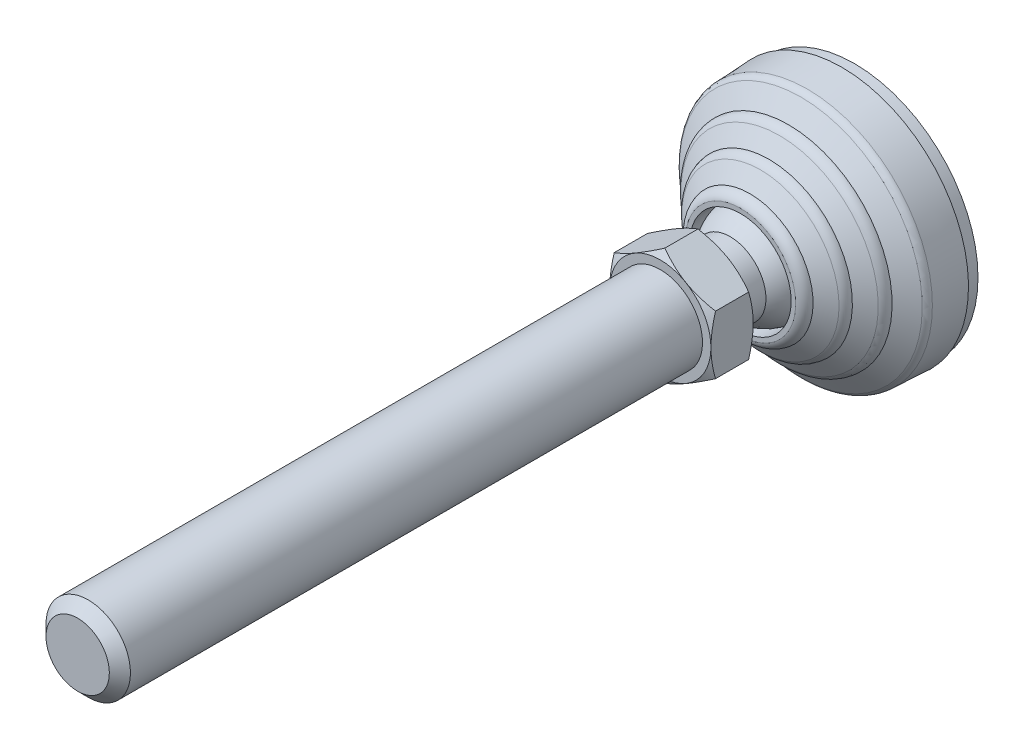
ISO-10303-21;
HEADER;
FILE_DESCRIPTION(('STEP AP214'),'2;1');
FILE_NAME('part.step','',(''),(''),'','','');
FILE_SCHEMA(('AUTOMOTIVE_DESIGN { 1 0 10303 214 1 1 1 1 }'));
ENDSEC;
DATA;
#1=APPLICATION_CONTEXT('core data for automotive mechanical design processes');
#2=APPLICATION_PROTOCOL_DEFINITION('international standard','automotive_design',2000,#1);
#3=PRODUCT_CONTEXT('',#1,'mechanical');
#4=PRODUCT('Part','Part','',(#3));
#5=PRODUCT_RELATED_PRODUCT_CATEGORY('part','',(#4));
#6=PRODUCT_DEFINITION_FORMATION('','',#4);
#7=PRODUCT_DEFINITION_CONTEXT('part definition',#1,'design');
#8=PRODUCT_DEFINITION('design','',#6,#7);
#9=PRODUCT_DEFINITION_SHAPE('','',#8);
#10=(LENGTH_UNIT() NAMED_UNIT(*) SI_UNIT(.MILLI.,.METRE.));
#11=(NAMED_UNIT(*) PLANE_ANGLE_UNIT() SI_UNIT($,.RADIAN.));
#12=(NAMED_UNIT(*) SI_UNIT($,.STERADIAN.) SOLID_ANGLE_UNIT());
#13=UNCERTAINTY_MEASURE_WITH_UNIT(LENGTH_MEASURE(1.E-05),#10,'distance_accuracy_value','');
#14=(GEOMETRIC_REPRESENTATION_CONTEXT(3) GLOBAL_UNCERTAINTY_ASSIGNED_CONTEXT((#13)) GLOBAL_UNIT_ASSIGNED_CONTEXT((#10,
#11,#12)) REPRESENTATION_CONTEXT('',''));
#15=CARTESIAN_POINT('',(0.,0.,0.));
#16=DIRECTION('',(0.,0.,1.));
#17=DIRECTION('',(1.,0.,0.));
#18=AXIS2_PLACEMENT_3D('',#15,#16,#17);
#19=CARTESIAN_POINT('',(0.,0.,93.4665));
#20=DIRECTION('',(0.,0.,-1.));
#21=DIRECTION('',(0.,1.,0.));
#22=AXIS2_PLACEMENT_3D('',#19,#20,#21);
#23=CYLINDRICAL_SURFACE('',#22,10.);
#24=CARTESIAN_POINT('',(0.,0.,181.5));
#25=DIRECTION('',(0.,0.,1.));
#26=DIRECTION('',(0.,-1.,0.));
#27=AXIS2_PLACEMENT_3D('',#24,#25,#26);
#28=CIRCLE('',#27,10.);
#29=CARTESIAN_POINT('',(0.,-10.,181.5));
#30=VERTEX_POINT('',#29);
#31=EDGE_CURVE('E9',#30,#30,#28,.F.);
#32=ORIENTED_EDGE('',*,*,#31,.T.);
#33=EDGE_LOOP('',(#32));
#34=FACE_BOUND('',#33,.T.);
#35=CARTESIAN_POINT('',(0.,0.,46.));
#36=DIRECTION('',(0.,0.,-1.));
#37=DIRECTION('',(0.,1.,0.));
#38=AXIS2_PLACEMENT_3D('',#35,#36,#37);
#39=CIRCLE('',#38,10.);
#40=CARTESIAN_POINT('',(0.,10.,46.));
#41=VERTEX_POINT('',#40);
#42=EDGE_CURVE('E124',#41,#41,#39,.F.);
#43=ORIENTED_EDGE('',*,*,#42,.T.);
#44=EDGE_LOOP('',(#43));
#45=FACE_BOUND('',#44,.T.);
#46=ADVANCED_FACE('F14',(#34,#45),#23,.T.);
#47=CARTESIAN_POINT('',(10.995,0.,46.));
#48=DIRECTION('',(0.,0.,1.));
#49=DIRECTION('',(0.,-1.,0.));
#50=AXIS2_PLACEMENT_3D('',#47,#48,#49);
#51=PLANE('',#50);
#52=CARTESIAN_POINT('',(0.,0.,46.));
#53=DIRECTION('',(0.,0.,-1.));
#54=DIRECTION('',(0.,1.,0.));
#55=AXIS2_PLACEMENT_3D('',#52,#53,#54);
#56=CIRCLE('',#55,11.99);
#57=CARTESIAN_POINT('',(0.,11.99,46.));
#58=VERTEX_POINT('',#57);
#59=EDGE_CURVE('E132',#58,#58,#56,.F.);
#60=ORIENTED_EDGE('',*,*,#59,.T.);
#61=EDGE_LOOP('',(#60));
#62=FACE_BOUND('',#61,.T.);
#63=ORIENTED_EDGE('',*,*,#42,.F.);
#64=EDGE_LOOP('',(#63));
#65=FACE_BOUND('',#64,.T.);
#66=ADVANCED_FACE('F157',(#62,#65),#51,.T.);
#67=CARTESIAN_POINT('',(0.,0.,44.9159643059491));
#68=DIRECTION('',(0.,0.,-1.));
#69=DIRECTION('',(0.,1.,0.));
#70=AXIS2_PLACEMENT_3D('',#67,#68,#69);
#71=CONICAL_SURFACE('',#70,13.8676048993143,1.0471975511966);
#72=ORIENTED_EDGE('',*,*,#59,.F.);
#73=EDGE_LOOP('',(#72));
#74=FACE_BOUND('',#73,.T.);
#75=CARTESIAN_POINT('',(-2.88482840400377E-08,-13.8564064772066,44.9224297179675));
#76=CARTESIAN_POINT('',(0.263784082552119,-13.7041106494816,45.010340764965));
#77=CARTESIAN_POINT('',(0.528551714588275,-13.5512469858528,45.0942615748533));
#78=CARTESIAN_POINT('',(1.06021019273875,-13.2442938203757,45.2530155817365));
#79=CARTESIAN_POINT('',(1.32710170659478,-13.0902039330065,45.3278457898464));
#80=CARTESIAN_POINT('',(2.13207647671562,-12.6254515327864,45.537252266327));
#81=CARTESIAN_POINT('',(2.67333741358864,-12.3129543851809,45.6563603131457));
#82=CARTESIAN_POINT('',(3.48330954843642,-11.8453167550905,45.796023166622));
#83=CARTESIAN_POINT('',(3.74960108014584,-11.6915732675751,45.8358073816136));
#84=CARTESIAN_POINT('',(4.28341699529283,-11.3833745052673,45.9025217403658));
#85=CARTESIAN_POINT('',(4.55094140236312,-11.2289192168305,45.9294516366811));
#86=CARTESIAN_POINT('',(5.08643614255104,-10.9197511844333,45.9697675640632));
#87=CARTESIAN_POINT('',(5.35440556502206,-10.7650389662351,45.9831696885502));
#88=CARTESIAN_POINT('',(5.8905925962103,-10.4554712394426,45.996144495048));
#89=CARTESIAN_POINT('',(6.15881019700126,-10.3006157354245,45.9957176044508));
#90=CARTESIAN_POINT('',(6.66023029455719,-10.0111207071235,45.9820002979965));
#91=CARTESIAN_POINT('',(6.89346857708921,-9.87646052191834,45.97038309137));
#92=CARTESIAN_POINT('',(7.35940867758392,-9.60744987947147,45.9369099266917));
#93=CARTESIAN_POINT('',(7.59211045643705,-9.47309944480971,45.9150532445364));
#94=CARTESIAN_POINT('',(8.05685109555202,-9.20478131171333,45.8614821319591));
#95=CARTESIAN_POINT('',(8.28888924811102,-9.07081402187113,45.8297595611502));
#96=CARTESIAN_POINT('',(8.75187776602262,-8.80350747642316,45.7570131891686));
#97=CARTESIAN_POINT('',(8.98282805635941,-8.67016826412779,45.7159887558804));
#98=CARTESIAN_POINT('',(9.68388987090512,-8.26541003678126,45.5779256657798));
#99=CARTESIAN_POINT('',(10.1519713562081,-7.99516306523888,45.4671213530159));
#100=CARTESIAN_POINT('',(11.081155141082,-7.45869855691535,45.2156417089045));
#101=CARTESIAN_POINT('',(11.5422693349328,-7.19247415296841,45.075025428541));
#102=CARTESIAN_POINT('',(11.9999999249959,-6.92820327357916,44.922429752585));
#103=B_SPLINE_CURVE_WITH_KNOTS('',3,(#75,#76,#77,#78,#79,#80,#81,#82,#83,#84,#85,#86,#87,#88,
#89,#90,#91,#92,#93,#94,#95,#96,#97,#98,#99,#100,#101,#102),.UNSPECIFIED.,.F.,.F.,(4,2,2,2,2,2,
2,2,2,2,2,2,2,4),(0.,0.950996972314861,1.90230578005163,3.80897261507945,4.73890631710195,
5.6688579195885,6.59770188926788,7.52651715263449,8.33503482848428,9.14360968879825,
9.95285348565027,10.7621522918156,12.4163368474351,14.0672749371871),.UNSPECIFIED.);
#104=CARTESIAN_POINT('',(-1.44241383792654E-08,-13.8564064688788,44.9224297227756));
#105=VERTEX_POINT('',#104);
#106=CARTESIAN_POINT('',(12.,-6.92820324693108,44.9224297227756));
#107=VERTEX_POINT('',#106);
#108=EDGE_CURVE('E143',#105,#107,#103,.T.);
#109=ORIENTED_EDGE('',*,*,#108,.T.);
#110=CARTESIAN_POINT('',(12.,-6.92820326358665,44.9224297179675));
#111=CARTESIAN_POINT('',(12.,-6.64374493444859,45.0045333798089));
#112=CARTESIAN_POINT('',(12.,-6.35829458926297,45.0831531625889));
#113=CARTESIAN_POINT('',(12.,-5.78524260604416,45.2325348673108));
#114=CARTESIAN_POINT('',(12.,-5.49764024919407,45.3032940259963));
#115=CARTESIAN_POINT('',(12.,-4.63053083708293,45.5026195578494));
#116=CARTESIAN_POINT('',(12.,-4.04782834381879,45.6179071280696));
#117=CARTESIAN_POINT('',(12.,-3.17548925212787,45.7575170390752));
#118=CARTESIAN_POINT('',(12.,-2.88840964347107,45.7982045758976));
#119=CARTESIAN_POINT('',(12.,-2.31290718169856,45.8685767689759));
#120=CARTESIAN_POINT('',(12.,-2.02448443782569,45.8982623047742));
#121=CARTESIAN_POINT('',(12.,-1.44696804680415,45.9459902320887));
#122=CARTESIAN_POINT('',(12.,-1.15787537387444,45.9640443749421));
#123=CARTESIAN_POINT('',(12.,-0.579188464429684,45.9881624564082));
#124=CARTESIAN_POINT('',(12.,-0.289594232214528,45.994226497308));
#125=CARTESIAN_POINT('',(12.,0.289594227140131,45.9942264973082));
#126=CARTESIAN_POINT('',(12.,0.579188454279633,45.9881624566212));
#127=CARTESIAN_POINT('',(12.,1.15787535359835,45.9640443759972));
#128=CARTESIAN_POINT('',(12.,1.44696802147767,45.9459902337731));
#129=CARTESIAN_POINT('',(12.,2.02448440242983,45.8982623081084));
#130=CARTESIAN_POINT('',(12.,2.31290714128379,45.8685767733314));
#131=CARTESIAN_POINT('',(12.,2.88840959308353,45.798204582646));
#132=CARTESIAN_POINT('',(12.,3.17548919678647,45.7575170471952));
#133=CARTESIAN_POINT('',(12.,4.04782827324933,45.6179071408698));
#134=CARTESIAN_POINT('',(12.,4.63053075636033,45.5026195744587));
#135=CARTESIAN_POINT('',(12.,5.49764015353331,45.3032940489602));
#136=CARTESIAN_POINT('',(12.,5.78524250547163,45.2325348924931));
#137=CARTESIAN_POINT('',(12.,6.35829447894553,45.0831531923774));
#138=CARTESIAN_POINT('',(12.,6.64374481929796,45.004533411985));
#139=CARTESIAN_POINT('',(12.,6.92820314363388,44.9224297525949));
#140=B_SPLINE_CURVE_WITH_KNOTS('',3,(#110,#111,#112,#113,#114,#115,#116,#117,#118,#119,#120,
#121,#122,#123,#124,#125,#126,#127,#128,#129,#130,#131,#132,#133,#134,#135,#136,#137,#138,#139),
.UNSPECIFIED.,.F.,.F.,(4,2,2,2,2,2,2,2,2,2,2,2,2,2,4),(0.,0.888148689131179,1.77660860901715,
3.55698615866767,4.42666281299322,5.2962699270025,6.16499708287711,7.03371682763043,
7.90243655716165,8.7711636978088,9.64077079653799,10.5104474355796,12.2908249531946,
13.1792848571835,14.0674335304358),.UNSPECIFIED.);
#141=CARTESIAN_POINT('',(12.0000000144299,6.92820322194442,44.9224297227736));
#142=VERTEX_POINT('',#141);
#143=EDGE_CURVE('E135',#107,#142,#140,.T.);
#144=ORIENTED_EDGE('',*,*,#143,.T.);
#145=CARTESIAN_POINT('',(12.0000000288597,6.92820321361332,44.9224297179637));
#146=CARTESIAN_POINT('',(11.7362159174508,7.08049904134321,45.0103407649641));
#147=CARTESIAN_POINT('',(11.4714482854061,7.23336270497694,45.0942615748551));
#148=CARTESIAN_POINT('',(10.9397898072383,7.54031587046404,45.2530155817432));
#149=CARTESIAN_POINT('',(10.6728982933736,7.69440575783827,45.3278457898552));
#150=CARTESIAN_POINT('',(9.86792352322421,8.15915815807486,45.5372522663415));
#151=CARTESIAN_POINT('',(9.32666258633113,8.47165530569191,45.6563603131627));
#152=CARTESIAN_POINT('',(8.51669045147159,8.93929293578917,45.7960231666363));
#153=CARTESIAN_POINT('',(8.25039891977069,9.0930364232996,45.8358073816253));
#154=CARTESIAN_POINT('',(7.71658300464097,9.40123518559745,45.9025217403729));
#155=CARTESIAN_POINT('',(7.44905859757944,9.55569047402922,45.9294516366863));
#156=CARTESIAN_POINT('',(6.91356385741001,9.86485850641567,45.9697675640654));
#157=CARTESIAN_POINT('',(6.64559443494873,10.0195707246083,45.9831696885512));
#158=CARTESIAN_POINT('',(6.10940740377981,10.3291384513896,45.996144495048));
#159=CARTESIAN_POINT('',(5.84118980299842,10.4839939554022,45.9957176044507));
#160=CARTESIAN_POINT('',(5.33976970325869,10.773488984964,45.9820002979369));
#161=CARTESIAN_POINT('',(5.10653141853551,10.9081491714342,45.970383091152));
#162=CARTESIAN_POINT('',(4.64059131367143,11.1771598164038,45.9369099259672));
#163=CARTESIAN_POINT('',(4.4078895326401,11.3115102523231,45.9150532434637));
#164=CARTESIAN_POINT('',(3.94314888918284,11.5798283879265,45.8614821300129));
#165=CARTESIAN_POINT('',(3.71111073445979,11.7137956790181,45.8297595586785));
#166=CARTESIAN_POINT('',(3.24812221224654,11.9811022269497,45.7570131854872));
#167=CARTESIAN_POINT('',(3.01717191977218,12.1144414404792,45.7159887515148));
#168=CARTESIAN_POINT('',(2.31611009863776,12.5191996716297,45.5779256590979));
#169=CARTESIAN_POINT('',(1.84802860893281,12.7894466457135,45.4671213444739));
#170=CARTESIAN_POINT('',(0.918844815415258,13.3259111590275,45.2156416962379));
#171=CARTESIAN_POINT('',(0.457730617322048,13.5921355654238,45.0750254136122));
#172=CARTESIAN_POINT('',(2.30778996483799E-08,13.856406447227,44.9224297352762));
#173=B_SPLINE_CURVE_WITH_KNOTS('',3,(#145,#146,#147,#148,#149,#150,#151,#152,#153,#154,#155,
#156,#157,#158,#159,#160,#161,#162,#163,#164,#165,#166,#167,#168,#169,#170,#171,#172),
.UNSPECIFIED.,.F.,.F.,(4,2,2,2,2,2,2,2,2,2,2,2,2,4),(0.,0.95099697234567,1.9023057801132,
3.8089726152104,4.73890631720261,5.66885791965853,6.59770188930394,7.52651715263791,
8.33503483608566,9.14360970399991,9.95285350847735,10.7621523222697,12.4163368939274,
14.0672749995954),.UNSPECIFIED.);
#174=CARTESIAN_POINT('',(-1.15389591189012E-08,13.856406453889,44.92242973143));
#175=VERTEX_POINT('',#174);
#176=EDGE_CURVE('E180',#142,#175,#173,.T.);
#177=ORIENTED_EDGE('',*,*,#176,.T.);
#178=CARTESIAN_POINT('',(-2.30779115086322E-08,13.856406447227,44.9224297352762));
#179=CARTESIAN_POINT('',(-0.263784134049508,13.7041106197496,45.0103407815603));
#180=CARTESIAN_POINT('',(-0.528551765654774,13.5512469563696,45.0942615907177));
#181=CARTESIAN_POINT('',(-1.06021024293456,13.2442937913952,45.2530155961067));
#182=CARTESIAN_POINT('',(-1.32710175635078,13.0902039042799,45.3278458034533));
#183=CARTESIAN_POINT('',(-2.13207652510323,12.6254515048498,45.5372522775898));
#184=CARTESIAN_POINT('',(-2.67333746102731,12.3129543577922,45.656360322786));
#185=CARTESIAN_POINT('',(-3.48330959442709,11.8453167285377,45.7960231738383));
#186=CARTESIAN_POINT('',(-3.74960112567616,11.6915732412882,45.8358073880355));
#187=CARTESIAN_POINT('',(-4.28341703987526,11.3833744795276,45.9025217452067));
#188=CARTESIAN_POINT('',(-4.55094144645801,11.2289191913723,45.9294516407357));
#189=CARTESIAN_POINT('',(-5.08643618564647,10.9197511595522,45.9697675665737));
#190=CARTESIAN_POINT('',(-5.35440560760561,10.7650389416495,45.9831696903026));
#191=CARTESIAN_POINT('',(-5.89059263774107,10.4554712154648,45.9961444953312));
#192=CARTESIAN_POINT('',(-6.15881023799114,10.300615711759,45.9957176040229));
#193=CARTESIAN_POINT('',(-6.66023033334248,10.0111206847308,45.9820002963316));
#194=CARTESIAN_POINT('',(-6.89346861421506,9.87646050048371,45.9703830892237));
#195=CARTESIAN_POINT('',(-7.35940871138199,9.60744985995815,45.9369099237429));
#196=CARTESIAN_POINT('',(-7.59211048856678,9.47309942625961,45.9150532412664));
#197=CARTESIAN_POINT('',(-8.05685112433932,9.20478129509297,45.8614821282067));
#198=CARTESIAN_POINT('',(-8.28888927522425,9.0708140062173,45.8297595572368));
#199=CARTESIAN_POINT('',(-8.75187778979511,8.80350746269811,45.7570131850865));
#200=CARTESIAN_POINT('',(-8.98282807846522,8.67016825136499,45.7159887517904));
#201=CARTESIAN_POINT('',(-9.68388988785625,8.26541002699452,45.5779256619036));
#202=CARTESIAN_POINT('',(-10.1519713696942,7.9951630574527,45.4671213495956));
#203=CARTESIAN_POINT('',(-11.0811551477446,7.45869855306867,45.2156417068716));
#204=CARTESIAN_POINT('',(-11.5422693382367,7.19247415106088,45.0750254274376));
#205=CARTESIAN_POINT('',(-11.9999999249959,6.92820327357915,44.922429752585));
#206=B_SPLINE_CURVE_WITH_KNOTS('',3,(#178,#179,#180,#181,#182,#183,#184,#185,#186,#187,#188,
#189,#190,#191,#192,#193,#194,#195,#196,#197,#198,#199,#200,#201,#202,#203,#204,#205),
.UNSPECIFIED.,.F.,.F.,(4,2,2,2,2,2,2,2,2,2,2,2,2,4),(0.,0.9509969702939,1.90230577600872,
3.80897260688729,4.73890630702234,5.6688579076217,6.5977018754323,7.52651713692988,
8.33503480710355,9.14360966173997,9.95285345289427,10.7621522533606,12.4163367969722,
14.0672748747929),.UNSPECIFIED.);
#207=CARTESIAN_POINT('',(-12.,6.92820324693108,44.9224297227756));
#208=VERTEX_POINT('',#207);
#209=EDGE_CURVE('E172',#175,#208,#206,.T.);
#210=ORIENTED_EDGE('',*,*,#209,.T.);
#211=CARTESIAN_POINT('',(-12.,6.92820326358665,44.9224297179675));
#212=CARTESIAN_POINT('',(-12.,6.64374493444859,45.0045333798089));
#213=CARTESIAN_POINT('',(-12.,6.35829458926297,45.0831531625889));
#214=CARTESIAN_POINT('',(-12.,5.78524260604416,45.2325348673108));
#215=CARTESIAN_POINT('',(-12.,5.49764024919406,45.3032940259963));
#216=CARTESIAN_POINT('',(-12.,4.63053083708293,45.5026195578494));
#217=CARTESIAN_POINT('',(-12.,4.04782834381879,45.6179071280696));
#218=CARTESIAN_POINT('',(-12.,3.17548925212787,45.7575170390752));
#219=CARTESIAN_POINT('',(-12.,2.88840964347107,45.7982045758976));
#220=CARTESIAN_POINT('',(-12.,2.31290718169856,45.8685767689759));
#221=CARTESIAN_POINT('',(-12.,2.02448443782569,45.8982623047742));
#222=CARTESIAN_POINT('',(-12.,1.44696804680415,45.9459902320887));
#223=CARTESIAN_POINT('',(-12.,1.15787537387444,45.9640443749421));
#224=CARTESIAN_POINT('',(-12.,0.579188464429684,45.9881624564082));
#225=CARTESIAN_POINT('',(-12.,0.289594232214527,45.994226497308));
#226=CARTESIAN_POINT('',(-12.,-0.289594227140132,45.9942264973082));
#227=CARTESIAN_POINT('',(-12.,-0.579188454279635,45.9881624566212));
#228=CARTESIAN_POINT('',(-12.,-1.15787535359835,45.9640443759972));
#229=CARTESIAN_POINT('',(-12.,-1.44696802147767,45.9459902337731));
#230=CARTESIAN_POINT('',(-12.,-2.02448440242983,45.8982623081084));
#231=CARTESIAN_POINT('',(-12.,-2.31290714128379,45.8685767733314));
#232=CARTESIAN_POINT('',(-12.,-2.88840959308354,45.798204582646));
#233=CARTESIAN_POINT('',(-12.,-3.17548919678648,45.7575170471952));
#234=CARTESIAN_POINT('',(-12.,-4.04782827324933,45.6179071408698));
#235=CARTESIAN_POINT('',(-12.,-4.63053075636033,45.5026195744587));
#236=CARTESIAN_POINT('',(-12.,-5.49764015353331,45.3032940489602));
#237=CARTESIAN_POINT('',(-12.,-5.78524250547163,45.2325348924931));
#238=CARTESIAN_POINT('',(-12.,-6.35829447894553,45.0831531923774));
#239=CARTESIAN_POINT('',(-12.,-6.64374481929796,45.004533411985));
#240=CARTESIAN_POINT('',(-12.,-6.92820314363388,44.9224297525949));
#241=B_SPLINE_CURVE_WITH_KNOTS('',3,(#211,#212,#213,#214,#215,#216,#217,#218,#219,#220,#221,
#222,#223,#224,#225,#226,#227,#228,#229,#230,#231,#232,#233,#234,#235,#236,#237,#238,#239,#240),
.UNSPECIFIED.,.F.,.F.,(4,2,2,2,2,2,2,2,2,2,2,2,2,2,4),(0.,0.888148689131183,1.77660860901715,
3.55698615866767,4.42666281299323,5.2962699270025,6.16499708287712,7.03371682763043,
7.90243655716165,8.7711636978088,9.640770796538,10.5104474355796,12.2908249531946,
13.1792848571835,14.0674335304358),.UNSPECIFIED.);
#242=CARTESIAN_POINT('',(-12.0000000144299,-6.92820322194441,44.9224297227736));
#243=VERTEX_POINT('',#242);
#244=EDGE_CURVE('E350',#208,#243,#241,.T.);
#245=ORIENTED_EDGE('',*,*,#244,.T.);
#246=CARTESIAN_POINT('',(-12.0000000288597,-6.92820321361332,44.9224297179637));
#247=CARTESIAN_POINT('',(-11.7362159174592,-7.08049904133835,45.0103407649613));
#248=CARTESIAN_POINT('',(-11.471448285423,-7.23336270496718,45.0942615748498));
#249=CARTESIAN_POINT('',(-10.9397898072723,-7.54031587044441,45.2530155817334));
#250=CARTESIAN_POINT('',(-10.6728982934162,-7.69440575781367,45.3278457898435));
#251=CARTESIAN_POINT('',(-9.86792352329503,-8.15915815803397,45.5372522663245));
#252=CARTESIAN_POINT('',(-9.3266625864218,-8.47165530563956,45.6563603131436));
#253=CARTESIAN_POINT('',(-8.5166904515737,-8.93929293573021,45.7960231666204));
#254=CARTESIAN_POINT('',(-8.25039891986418,-9.09303642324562,45.8358073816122));
#255=CARTESIAN_POINT('',(-7.71658300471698,-9.40123518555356,45.9025217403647));
#256=CARTESIAN_POINT('',(-7.44905859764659,-9.55569047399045,45.9294516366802));
#257=CARTESIAN_POINT('',(-6.91356385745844,-9.8648585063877,45.9697675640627));
#258=CARTESIAN_POINT('',(-6.64559443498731,-10.019570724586,45.9831696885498));
#259=CARTESIAN_POINT('',(-6.10940740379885,-10.3291384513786,45.996144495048));
#260=CARTESIAN_POINT('',(-5.84118980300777,-10.4839939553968,45.9957176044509));
#261=CARTESIAN_POINT('',(-5.33976970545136,-10.7734889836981,45.9820002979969));
#262=CARTESIAN_POINT('',(-5.10653142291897,-10.9081491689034,45.9703830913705));
#263=CARTESIAN_POINT('',(-4.64059132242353,-11.1771598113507,45.9369099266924));
#264=CARTESIAN_POINT('',(-4.40788954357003,-11.3115102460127,45.9150532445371));
#265=CARTESIAN_POINT('',(-3.94314890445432,-11.5798283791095,45.8614821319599));
#266=CARTESIAN_POINT('',(-3.71111075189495,-11.7137956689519,45.8297595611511));
#267=CARTESIAN_POINT('',(-3.24812223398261,-11.9811022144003,45.7570131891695));
#268=CARTESIAN_POINT('',(-3.01717194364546,-12.1144414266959,45.7159887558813));
#269=CARTESIAN_POINT('',(-2.3161101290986,-12.5191996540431,45.5779256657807));
#270=CARTESIAN_POINT('',(-1.84802864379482,-12.7894466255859,45.4671213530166));
#271=CARTESIAN_POINT('',(-0.918844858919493,-13.3259111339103,45.215641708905));
#272=CARTESIAN_POINT('',(-0.457730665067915,-13.5921355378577,45.0750254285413));
#273=CARTESIAN_POINT('',(-7.50040961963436E-08,-13.8564064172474,44.922429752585));
#274=B_SPLINE_CURVE_WITH_KNOTS('',3,(#246,#247,#248,#249,#250,#251,#252,#253,#254,#255,#256,
#257,#258,#259,#260,#261,#262,#263,#264,#265,#266,#267,#268,#269,#270,#271,#272,#273),
.UNSPECIFIED.,.F.,.F.,(4,2,2,2,2,2,2,2,2,2,2,2,2,4),(0.,0.950996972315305,1.90230578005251,
3.80897261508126,4.73890631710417,5.66885791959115,6.59770188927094,7.52651715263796,
8.33503482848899,9.14360968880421,9.95285348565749,10.7621522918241,12.4163368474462,
14.0672749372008),.UNSPECIFIED.);
#275=EDGE_CURVE('E162',#243,#105,#274,.T.);
#276=ORIENTED_EDGE('',*,*,#275,.T.);
#277=EDGE_LOOP('',(#109,#144,#177,#210,#245,#276));
#278=FACE_BOUND('',#277,.T.);
#279=ADVANCED_FACE('F152',(#74,#278),#71,.T.);
#280=CARTESIAN_POINT('',(0.,-13.856406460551,46.1));
#281=DIRECTION('',(0.5,0.866025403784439,0.));
#282=DIRECTION('',(-0.866025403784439,0.5,0.));
#283=AXIS2_PLACEMENT_3D('',#280,#281,#282);
#284=PLANE('',#283);
#285=DIRECTION('',(0.,0.,1.));
#286=VECTOR('',#285,1.);
#287=CARTESIAN_POINT('',(0.,-13.856406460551,46.1));
#288=LINE('',#287,#286);
#289=CARTESIAN_POINT('',(0.,-13.856406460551,37.0775702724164));
#290=VERTEX_POINT('',#289);
#291=EDGE_CURVE('E376',#290,#105,#288,.T.);
#292=ORIENTED_EDGE('',*,*,#291,.T.);
#293=ORIENTED_EDGE('',*,*,#275,.F.);
#294=DIRECTION('',(0.,0.,1.));
#295=VECTOR('',#294,1.);
#296=CARTESIAN_POINT('',(-12.,-6.9282032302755,46.1));
#297=LINE('',#296,#295);
#298=CARTESIAN_POINT('',(-12.,-6.9282032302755,37.0775702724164));
#299=VERTEX_POINT('',#298);
#300=EDGE_CURVE('E368',#299,#243,#297,.T.);
#301=ORIENTED_EDGE('',*,*,#300,.F.);
#302=CARTESIAN_POINT('',(0.,-13.856406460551,37.0775702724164));
#303=CARTESIAN_POINT('',(-0.263784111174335,-13.7041106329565,36.9896592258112));
#304=CARTESIAN_POINT('',(-0.528551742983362,-13.5512469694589,36.9057384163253));
#305=CARTESIAN_POINT('',(-1.0602102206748,-13.2442938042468,36.7469844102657));
#306=CARTESIAN_POINT('',(-1.32710173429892,-13.0902039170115,36.6721542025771));
#307=CARTESIAN_POINT('',(-2.13207650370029,-12.6254515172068,36.4627477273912));
#308=CARTESIAN_POINT('',(-2.67333744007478,-12.3129543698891,36.3436396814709));
#309=CARTESIAN_POINT('',(-3.48330957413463,-11.8453167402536,36.2039768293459));
#310=CARTESIAN_POINT('',(-3.74960110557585,-11.6915732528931,36.1641926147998));
#311=CARTESIAN_POINT('',(-4.28341702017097,-11.3833744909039,36.097478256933));
#312=CARTESIAN_POINT('',(-4.55094142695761,-11.2289192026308,36.0705483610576));
#313=CARTESIAN_POINT('',(-5.08643616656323,-10.9197511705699,36.0302324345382));
#314=CARTESIAN_POINT('',(-5.35440558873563,-10.765038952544,36.0168303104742));
#315=CARTESIAN_POINT('',(-5.89059261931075,-10.4554712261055,36.0038555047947));
#316=CARTESIAN_POINT('',(-6.15881021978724,-10.300615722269,36.0042823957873));
#317=CARTESIAN_POINT('',(-6.66023031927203,-10.0111206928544,36.0179997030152));
#318=CARTESIAN_POINT('',(-6.8934686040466,-9.87646050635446,36.029616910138));
#319=CARTESIAN_POINT('',(-7.35940870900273,-9.6074498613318,36.063090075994));
#320=CARTESIAN_POINT('',(-7.59211049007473,-9.47309942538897,36.0849467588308));
#321=CARTESIAN_POINT('',(-8.05685113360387,-9.20478128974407,36.1385178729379));
#322=CARTESIAN_POINT('',(-8.28888928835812,-9.07081399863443,36.1702404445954));
#323=CARTESIAN_POINT('',(-8.75187781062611,-8.8035074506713,36.2429868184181));
#324=CARTESIAN_POINT('',(-8.98282810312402,-8.67016823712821,36.2840112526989));
#325=CARTESIAN_POINT('',(-9.6838899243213,-8.2654100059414,36.4220743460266));
#326=CARTESIAN_POINT('',(-10.1519714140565,-7.99516303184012,36.5328786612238));
#327=CARTESIAN_POINT('',(-11.0811552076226,-7.45869851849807,36.7843583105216));
#328=CARTESIAN_POINT('',(-11.5422694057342,-7.19247411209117,36.924974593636));
#329=CARTESIAN_POINT('',(-12.,-6.9282032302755,37.0775702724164));
#330=B_SPLINE_CURVE_WITH_KNOTS('',3,(#302,#303,#304,#305,#306,#307,#308,#309,#310,#311,#312,
#313,#314,#315,#316,#317,#318,#319,#320,#321,#322,#323,#324,#325,#326,#327,#328,#329),
.UNSPECIFIED.,.F.,.F.,(4,2,2,2,2,2,2,2,2,2,2,2,2,4),(0.,0.950996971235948,1.90230577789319,
3.80897261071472,4.73890631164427,5.66885791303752,6.59770188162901,7.52651714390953,
8.33503482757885,9.14360969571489,9.9528535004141,10.7621523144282,12.4163368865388,
14.0672749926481),.UNSPECIFIED.);
#331=EDGE_CURVE('E370',#290,#299,#330,.T.);
#332=ORIENTED_EDGE('',*,*,#331,.F.);
#333=EDGE_LOOP('',(#292,#293,#301,#332));
#334=FACE_BOUND('',#333,.T.);
#335=ADVANCED_FACE('F156',(#334),#284,.F.);
#336=CARTESIAN_POINT('',(12.,-6.92820323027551,46.1));
#337=DIRECTION('',(-0.5,0.866025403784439,0.));
#338=DIRECTION('',(-0.866025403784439,-0.5,0.));
#339=AXIS2_PLACEMENT_3D('',#336,#337,#338);
#340=PLANE('',#339);
#341=DIRECTION('',(0.,0.,1.));
#342=VECTOR('',#341,1.);
#343=CARTESIAN_POINT('',(12.,-6.92820323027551,46.1));
#344=LINE('',#343,#342);
#345=CARTESIAN_POINT('',(12.,-6.92820323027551,37.0775702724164));
#346=VERTEX_POINT('',#345);
#347=EDGE_CURVE('E31',#346,#107,#344,.T.);
#348=ORIENTED_EDGE('',*,*,#347,.T.);
#349=ORIENTED_EDGE('',*,*,#108,.F.);
#350=ORIENTED_EDGE('',*,*,#291,.F.);
#351=CARTESIAN_POINT('',(12.,-6.92820323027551,37.0775702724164));
#352=CARTESIAN_POINT('',(11.7362158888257,-7.08049905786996,36.9896592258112));
#353=CARTESIAN_POINT('',(11.4714482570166,-7.2333627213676,36.9057384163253));
#354=CARTESIAN_POINT('',(10.9397897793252,-7.5403158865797,36.7469844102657));
#355=CARTESIAN_POINT('',(10.6728982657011,-7.69440577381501,36.6721542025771));
#356=CARTESIAN_POINT('',(9.86792349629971,-8.15915817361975,36.4627477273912));
#357=CARTESIAN_POINT('',(9.32666255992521,-8.4716553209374,36.3436396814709));
#358=CARTESIAN_POINT('',(8.51669042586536,-8.93929295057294,36.2039768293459));
#359=CARTESIAN_POINT('',(8.25039889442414,-9.09303643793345,36.1641926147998));
#360=CARTESIAN_POINT('',(7.71658297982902,-9.40123519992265,36.097478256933));
#361=CARTESIAN_POINT('',(7.44905857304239,-9.55569048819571,36.0705483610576));
#362=CARTESIAN_POINT('',(6.91356383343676,-9.86485852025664,36.0302324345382));
#363=CARTESIAN_POINT('',(6.64559441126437,-10.0195707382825,36.0168303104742));
#364=CARTESIAN_POINT('',(6.10940738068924,-10.329138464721,36.0038555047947));
#365=CARTESIAN_POINT('',(5.84118978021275,-10.4839939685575,36.0042823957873));
#366=CARTESIAN_POINT('',(5.33976968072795,-10.7734889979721,36.0179997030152));
#367=CARTESIAN_POINT('',(5.10653139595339,-10.9081491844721,36.029616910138));
#368=CARTESIAN_POINT('',(4.64059129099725,-11.1771598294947,36.063090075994));
#369=CARTESIAN_POINT('',(4.40788950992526,-11.3115102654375,36.0849467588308));
#370=CARTESIAN_POINT('',(3.94314886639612,-11.5798284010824,36.1385178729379));
#371=CARTESIAN_POINT('',(3.71111071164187,-11.7137956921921,36.1702404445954));
#372=CARTESIAN_POINT('',(3.24812218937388,-11.9811022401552,36.2429868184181));
#373=CARTESIAN_POINT('',(3.01717189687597,-12.1144414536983,36.2840112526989));
#374=CARTESIAN_POINT('',(2.3161100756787,-12.5191996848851,36.4220743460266));
#375=CARTESIAN_POINT('',(1.84802858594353,-12.7894466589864,36.5328786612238));
#376=CARTESIAN_POINT('',(0.918844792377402,-13.3259111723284,36.7843583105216));
#377=CARTESIAN_POINT('',(0.457730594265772,-13.5921355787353,36.924974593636));
#378=CARTESIAN_POINT('',(0.,-13.856406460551,37.0775702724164));
#379=B_SPLINE_CURVE_WITH_KNOTS('',3,(#351,#352,#353,#354,#355,#356,#357,#358,#359,#360,#361,
#362,#363,#364,#365,#366,#367,#368,#369,#370,#371,#372,#373,#374,#375,#376,#377,#378),
.UNSPECIFIED.,.F.,.F.,(4,2,2,2,2,2,2,2,2,2,2,2,2,4),(0.,0.95099697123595,1.90230577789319,
3.80897261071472,4.73890631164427,5.66885791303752,6.59770188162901,7.52651714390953,
8.33503482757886,9.14360969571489,9.9528535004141,10.7621523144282,12.4163368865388,
14.0672749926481),.UNSPECIFIED.);
#380=EDGE_CURVE('E377',#346,#290,#379,.T.);
#381=ORIENTED_EDGE('',*,*,#380,.F.);
#382=EDGE_LOOP('',(#348,#349,#350,#381));
#383=FACE_BOUND('',#382,.T.);
#384=ADVANCED_FACE('F383',(#383),#340,.F.);
#385=CARTESIAN_POINT('',(-12.,6.92820323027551,46.1));
#386=DIRECTION('',(0.5,-0.866025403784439,0.));
#387=DIRECTION('',(0.866025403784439,0.5,0.));
#388=AXIS2_PLACEMENT_3D('',#385,#386,#387);
#389=PLANE('',#388);
#390=DIRECTION('',(0.,0.,1.));
#391=VECTOR('',#390,1.);
#392=CARTESIAN_POINT('',(-12.,6.92820323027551,46.1));
#393=LINE('',#392,#391);
#394=CARTESIAN_POINT('',(-12.,6.92820323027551,37.0775702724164));
#395=VERTEX_POINT('',#394);
#396=EDGE_CURVE('E369',#395,#208,#393,.T.);
#397=ORIENTED_EDGE('',*,*,#396,.T.);
#398=ORIENTED_EDGE('',*,*,#209,.F.);
#399=DIRECTION('',(0.,0.,1.));
#400=VECTOR('',#399,1.);
#401=CARTESIAN_POINT('',(0.,13.856406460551,46.1));
#402=LINE('',#401,#400);
#403=CARTESIAN_POINT('',(0.,13.856406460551,37.0775702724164));
#404=VERTEX_POINT('',#403);
#405=EDGE_CURVE('E211',#404,#175,#402,.T.);
#406=ORIENTED_EDGE('',*,*,#405,.F.);
#407=CARTESIAN_POINT('',(-12.,6.92820323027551,37.0775702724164));
#408=CARTESIAN_POINT('',(-11.7362158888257,7.08049905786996,36.9896592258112));
#409=CARTESIAN_POINT('',(-11.4714482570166,7.2333627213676,36.9057384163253));
#410=CARTESIAN_POINT('',(-10.9397897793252,7.5403158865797,36.7469844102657));
#411=CARTESIAN_POINT('',(-10.6728982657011,7.69440577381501,36.6721542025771));
#412=CARTESIAN_POINT('',(-9.86792349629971,8.15915817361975,36.4627477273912));
#413=CARTESIAN_POINT('',(-9.32666255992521,8.4716553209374,36.3436396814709));
#414=CARTESIAN_POINT('',(-8.51669042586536,8.93929295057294,36.2039768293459));
#415=CARTESIAN_POINT('',(-8.25039889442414,9.09303643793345,36.1641926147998));
#416=CARTESIAN_POINT('',(-7.71658297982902,9.40123519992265,36.097478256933));
#417=CARTESIAN_POINT('',(-7.44905857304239,9.55569048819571,36.0705483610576));
#418=CARTESIAN_POINT('',(-6.91356383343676,9.86485852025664,36.0302324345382));
#419=CARTESIAN_POINT('',(-6.64559441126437,10.0195707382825,36.0168303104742));
#420=CARTESIAN_POINT('',(-6.10940738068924,10.329138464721,36.0038555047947));
#421=CARTESIAN_POINT('',(-5.84118978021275,10.4839939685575,36.0042823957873));
#422=CARTESIAN_POINT('',(-5.33976968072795,10.7734889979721,36.0179997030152));
#423=CARTESIAN_POINT('',(-5.10653139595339,10.9081491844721,36.029616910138));
#424=CARTESIAN_POINT('',(-4.64059129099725,11.1771598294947,36.063090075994));
#425=CARTESIAN_POINT('',(-4.40788950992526,11.3115102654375,36.0849467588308));
#426=CARTESIAN_POINT('',(-3.94314886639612,11.5798284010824,36.1385178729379));
#427=CARTESIAN_POINT('',(-3.71111071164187,11.7137956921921,36.1702404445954));
#428=CARTESIAN_POINT('',(-3.24812218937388,11.9811022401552,36.2429868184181));
#429=CARTESIAN_POINT('',(-3.01717189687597,12.1144414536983,36.2840112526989));
#430=CARTESIAN_POINT('',(-2.3161100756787,12.5191996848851,36.4220743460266));
#431=CARTESIAN_POINT('',(-1.84802858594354,12.7894466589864,36.5328786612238));
#432=CARTESIAN_POINT('',(-0.918844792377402,13.3259111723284,36.7843583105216));
#433=CARTESIAN_POINT('',(-0.457730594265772,13.5921355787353,36.924974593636));
#434=CARTESIAN_POINT('',(0.,13.856406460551,37.0775702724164));
#435=B_SPLINE_CURVE_WITH_KNOTS('',3,(#407,#408,#409,#410,#411,#412,#413,#414,#415,#416,#417,
#418,#419,#420,#421,#422,#423,#424,#425,#426,#427,#428,#429,#430,#431,#432,#433,#434),
.UNSPECIFIED.,.F.,.F.,(4,2,2,2,2,2,2,2,2,2,2,2,2,4),(0.,0.95099697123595,1.90230577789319,
3.80897261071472,4.73890631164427,5.66885791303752,6.59770188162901,7.52651714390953,
8.33503482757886,9.14360969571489,9.9528535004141,10.7621523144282,12.4163368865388,
14.0672749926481),.UNSPECIFIED.);
#436=EDGE_CURVE('E213',#395,#404,#435,.T.);
#437=ORIENTED_EDGE('',*,*,#436,.F.);
#438=EDGE_LOOP('',(#397,#398,#406,#437));
#439=FACE_BOUND('',#438,.T.);
#440=ADVANCED_FACE('F199',(#439),#389,.F.);
#441=CARTESIAN_POINT('',(-12.,-6.92820323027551,46.1));
#442=DIRECTION('',(1.,0.,0.));
#443=DIRECTION('',(0.,1.,0.));
#444=AXIS2_PLACEMENT_3D('',#441,#442,#443);
#445=PLANE('',#444);
#446=ORIENTED_EDGE('',*,*,#300,.T.);
#447=ORIENTED_EDGE('',*,*,#244,.F.);
#448=ORIENTED_EDGE('',*,*,#396,.F.);
#449=CARTESIAN_POINT('',(-12.,-6.9282032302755,37.0775702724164));
#450=CARTESIAN_POINT('',(-12.,-6.64374490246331,36.9954666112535));
#451=CARTESIAN_POINT('',(-12.,-6.35829455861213,36.9168468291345));
#452=CARTESIAN_POINT('',(-12.,-5.78524257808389,36.7674651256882));
#453=CARTESIAN_POINT('',(-12.,-5.49764022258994,36.6967059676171));
#454=CARTESIAN_POINT('',(-12.,-4.63053081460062,36.4973804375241));
#455=CARTESIAN_POINT('',(-12.,-4.04782832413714,36.3820928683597));
#456=CARTESIAN_POINT('',(-12.,-3.17548923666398,36.2424829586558));
#457=CARTESIAN_POINT('',(-12.,-2.88840962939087,36.2017954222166));
#458=CARTESIAN_POINT('',(-12.,-2.31290717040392,36.1314232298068));
#459=CARTESIAN_POINT('',(-12.,-2.02448442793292,36.1017376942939));
#460=CARTESIAN_POINT('',(-12.,-1.44696803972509,36.0540097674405));
#461=CARTESIAN_POINT('',(-12.,-1.1578753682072,36.035955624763));
#462=CARTESIAN_POINT('',(-12.,-0.579188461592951,36.0118375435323));
#463=CARTESIAN_POINT('',(-12.,-0.289594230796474,36.0057735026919));
#464=CARTESIAN_POINT('',(-12.,0.28959423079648,36.0057735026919));
#465=CARTESIAN_POINT('',(-12.,0.579188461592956,36.0118375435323));
#466=CARTESIAN_POINT('',(-12.,1.15787536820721,36.035955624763));
#467=CARTESIAN_POINT('',(-12.,1.4469680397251,36.0540097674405));
#468=CARTESIAN_POINT('',(-12.,2.02448442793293,36.1017376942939));
#469=CARTESIAN_POINT('',(-12.,2.31290717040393,36.1314232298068));
#470=CARTESIAN_POINT('',(-12.,2.88840962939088,36.2017954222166));
#471=CARTESIAN_POINT('',(-12.,3.17548923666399,36.2424829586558));
#472=CARTESIAN_POINT('',(-12.,4.04782832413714,36.3820928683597));
#473=CARTESIAN_POINT('',(-12.,4.63053081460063,36.4973804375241));
#474=CARTESIAN_POINT('',(-12.,5.49764022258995,36.6967059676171));
#475=CARTESIAN_POINT('',(-12.,5.7852425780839,36.7674651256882));
#476=CARTESIAN_POINT('',(-12.,6.35829455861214,36.9168468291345));
#477=CARTESIAN_POINT('',(-12.,6.64374490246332,36.9954666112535));
#478=CARTESIAN_POINT('',(-12.,6.92820323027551,37.0775702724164));
#479=B_SPLINE_CURVE_WITH_KNOTS('',3,(#449,#450,#451,#452,#453,#454,#455,#456,#457,#458,#459,
#460,#461,#462,#463,#464,#465,#466,#467,#468,#469,#470,#471,#472,#473,#474,#475,#476,#477,#478),
.UNSPECIFIED.,.F.,.F.,(4,2,2,2,2,2,2,2,2,2,2,2,2,2,4),(0.,0.888148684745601,1.77660860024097,
3.55698614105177,4.42666279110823,5.29626990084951,6.16499705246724,7.03371679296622,
7.90243653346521,8.77116368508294,9.64077079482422,10.5104474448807,12.2908249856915,
13.1792849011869,14.0674335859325),.UNSPECIFIED.);
#480=EDGE_CURVE('E362',#299,#395,#479,.T.);
#481=ORIENTED_EDGE('',*,*,#480,.F.);
#482=EDGE_LOOP('',(#446,#447,#448,#481));
#483=FACE_BOUND('',#482,.T.);
#484=ADVANCED_FACE('F356',(#483),#445,.F.);
#485=CARTESIAN_POINT('',(12.,6.92820323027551,46.1));
#486=DIRECTION('',(-1.,0.,0.));
#487=DIRECTION('',(0.,-1.,0.));
#488=AXIS2_PLACEMENT_3D('',#485,#486,#487);
#489=PLANE('',#488);
#490=DIRECTION('',(0.,0.,1.));
#491=VECTOR('',#490,1.);
#492=CARTESIAN_POINT('',(12.,6.92820323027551,46.1));
#493=LINE('',#492,#491);
#494=CARTESIAN_POINT('',(12.,6.9282032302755,37.0775702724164));
#495=VERTEX_POINT('',#494);
#496=EDGE_CURVE('E410',#142,#495,#493,.F.);
#497=ORIENTED_EDGE('',*,*,#496,.F.);
#498=ORIENTED_EDGE('',*,*,#143,.F.);
#499=ORIENTED_EDGE('',*,*,#347,.F.);
#500=CARTESIAN_POINT('',(12.,6.92820323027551,37.0775702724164));
#501=CARTESIAN_POINT('',(12.,6.64374490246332,36.9954666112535));
#502=CARTESIAN_POINT('',(12.,6.35829455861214,36.9168468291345));
#503=CARTESIAN_POINT('',(12.,5.7852425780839,36.7674651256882));
#504=CARTESIAN_POINT('',(12.,5.49764022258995,36.6967059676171));
#505=CARTESIAN_POINT('',(12.,4.63053081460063,36.4973804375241));
#506=CARTESIAN_POINT('',(12.,4.04782832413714,36.3820928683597));
#507=CARTESIAN_POINT('',(12.,3.17548923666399,36.2424829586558));
#508=CARTESIAN_POINT('',(12.,2.88840962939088,36.2017954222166));
#509=CARTESIAN_POINT('',(12.,2.31290717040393,36.1314232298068));
#510=CARTESIAN_POINT('',(12.,2.02448442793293,36.1017376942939));
#511=CARTESIAN_POINT('',(12.,1.4469680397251,36.0540097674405));
#512=CARTESIAN_POINT('',(12.,1.1578753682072,36.035955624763));
#513=CARTESIAN_POINT('',(12.,0.579188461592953,36.0118375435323));
#514=CARTESIAN_POINT('',(12.,0.289594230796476,36.0057735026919));
#515=CARTESIAN_POINT('',(12.,-0.289594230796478,36.0057735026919));
#516=CARTESIAN_POINT('',(12.,-0.579188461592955,36.0118375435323));
#517=CARTESIAN_POINT('',(12.,-1.15787536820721,36.035955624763));
#518=CARTESIAN_POINT('',(12.,-1.4469680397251,36.0540097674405));
#519=CARTESIAN_POINT('',(12.,-2.02448442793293,36.1017376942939));
#520=CARTESIAN_POINT('',(12.,-2.31290717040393,36.1314232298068));
#521=CARTESIAN_POINT('',(12.,-2.88840962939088,36.2017954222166));
#522=CARTESIAN_POINT('',(12.,-3.17548923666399,36.2424829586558));
#523=CARTESIAN_POINT('',(12.,-4.04782832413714,36.3820928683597));
#524=CARTESIAN_POINT('',(12.,-4.63053081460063,36.4973804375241));
#525=CARTESIAN_POINT('',(12.,-5.49764022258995,36.6967059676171));
#526=CARTESIAN_POINT('',(12.,-5.7852425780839,36.7674651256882));
#527=CARTESIAN_POINT('',(12.,-6.35829455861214,36.9168468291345));
#528=CARTESIAN_POINT('',(12.,-6.64374490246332,36.9954666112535));
#529=CARTESIAN_POINT('',(12.,-6.92820323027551,37.0775702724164));
#530=B_SPLINE_CURVE_WITH_KNOTS('',3,(#500,#501,#502,#503,#504,#505,#506,#507,#508,#509,#510,
#511,#512,#513,#514,#515,#516,#517,#518,#519,#520,#521,#522,#523,#524,#525,#526,#527,#528,#529),
.UNSPECIFIED.,.F.,.F.,(4,2,2,2,2,2,2,2,2,2,2,2,2,2,4),(0.,0.888148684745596,1.77660860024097,
3.55698614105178,4.42666279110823,5.29626990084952,6.16499705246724,7.03371679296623,
7.90243653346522,8.77116368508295,9.64077079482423,10.5104474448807,12.2908249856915,
13.1792849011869,14.0674335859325),.UNSPECIFIED.);
#531=EDGE_CURVE('E188',#495,#346,#530,.T.);
#532=ORIENTED_EDGE('',*,*,#531,.F.);
#533=EDGE_LOOP('',(#497,#498,#499,#532));
#534=FACE_BOUND('',#533,.T.);
#535=ADVANCED_FACE('F150',(#534),#489,.F.);
#536=CARTESIAN_POINT('',(0.,13.856406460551,46.1));
#537=DIRECTION('',(-0.5,-0.866025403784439,0.));
#538=DIRECTION('',(0.866025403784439,-0.5,0.));
#539=AXIS2_PLACEMENT_3D('',#536,#537,#538);
#540=PLANE('',#539);
#541=ORIENTED_EDGE('',*,*,#405,.T.);
#542=ORIENTED_EDGE('',*,*,#176,.F.);
#543=ORIENTED_EDGE('',*,*,#496,.T.);
#544=CARTESIAN_POINT('',(0.,13.856406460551,37.0775702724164));
#545=CARTESIAN_POINT('',(0.263784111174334,13.7041106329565,36.9896592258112));
#546=CARTESIAN_POINT('',(0.528551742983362,13.5512469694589,36.9057384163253));
#547=CARTESIAN_POINT('',(1.0602102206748,13.2442938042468,36.7469844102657));
#548=CARTESIAN_POINT('',(1.32710173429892,13.0902039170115,36.6721542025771));
#549=CARTESIAN_POINT('',(2.13207650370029,12.6254515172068,36.4627477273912));
#550=CARTESIAN_POINT('',(2.67333744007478,12.3129543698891,36.3436396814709));
#551=CARTESIAN_POINT('',(3.48330957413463,11.8453167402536,36.2039768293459));
#552=CARTESIAN_POINT('',(3.74960110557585,11.6915732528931,36.1641926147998));
#553=CARTESIAN_POINT('',(4.28341702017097,11.3833744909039,36.097478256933));
#554=CARTESIAN_POINT('',(4.55094142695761,11.2289192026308,36.0705483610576));
#555=CARTESIAN_POINT('',(5.08643616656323,10.9197511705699,36.0302324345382));
#556=CARTESIAN_POINT('',(5.35440558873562,10.765038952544,36.0168303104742));
#557=CARTESIAN_POINT('',(5.89059261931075,10.4554712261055,36.0038555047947));
#558=CARTESIAN_POINT('',(6.15881021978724,10.300615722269,36.0042823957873));
#559=CARTESIAN_POINT('',(6.66023031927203,10.0111206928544,36.0179997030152));
#560=CARTESIAN_POINT('',(6.8934686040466,9.87646050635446,36.029616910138));
#561=CARTESIAN_POINT('',(7.35940870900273,9.6074498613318,36.063090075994));
#562=CARTESIAN_POINT('',(7.59211049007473,9.47309942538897,36.0849467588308));
#563=CARTESIAN_POINT('',(8.05685113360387,9.20478128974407,36.1385178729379));
#564=CARTESIAN_POINT('',(8.28888928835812,9.07081399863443,36.1702404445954));
#565=CARTESIAN_POINT('',(8.75187781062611,8.8035074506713,36.2429868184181));
#566=CARTESIAN_POINT('',(8.98282810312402,8.67016823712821,36.2840112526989));
#567=CARTESIAN_POINT('',(9.6838899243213,8.2654100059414,36.4220743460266));
#568=CARTESIAN_POINT('',(10.1519714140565,7.99516303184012,36.5328786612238));
#569=CARTESIAN_POINT('',(11.0811552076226,7.45869851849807,36.7843583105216));
#570=CARTESIAN_POINT('',(11.5422694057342,7.19247411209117,36.924974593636));
#571=CARTESIAN_POINT('',(12.,6.9282032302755,37.0775702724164));
#572=B_SPLINE_CURVE_WITH_KNOTS('',3,(#544,#545,#546,#547,#548,#549,#550,#551,#552,#553,#554,
#555,#556,#557,#558,#559,#560,#561,#562,#563,#564,#565,#566,#567,#568,#569,#570,#571),
.UNSPECIFIED.,.F.,.F.,(4,2,2,2,2,2,2,2,2,2,2,2,2,4),(0.,0.950996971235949,1.90230577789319,
3.80897261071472,4.73890631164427,5.66885791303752,6.59770188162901,7.52651714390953,
8.33503482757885,9.14360969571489,9.9528535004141,10.7621523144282,12.4163368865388,
14.0672749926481),.UNSPECIFIED.);
#573=EDGE_CURVE('E68',#404,#495,#572,.T.);
#574=ORIENTED_EDGE('',*,*,#573,.F.);
#575=EDGE_LOOP('',(#541,#542,#543,#574));
#576=FACE_BOUND('',#575,.T.);
#577=ADVANCED_FACE('F195',(#576),#540,.F.);
#578=CARTESIAN_POINT('',(0.,0.,37.0840356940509));
#579=DIRECTION('',(0.,0.,1.));
#580=DIRECTION('',(0.,-1.,0.));
#581=AXIS2_PLACEMENT_3D('',#578,#579,#580);
#582=CONICAL_SURFACE('',#581,13.8676048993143,1.0471975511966);
#583=CARTESIAN_POINT('',(0.,0.,36.));
#584=DIRECTION('',(0.,0.,1.));
#585=DIRECTION('',(0.,-1.,0.));
#586=AXIS2_PLACEMENT_3D('',#583,#584,#585);
#587=CIRCLE('',#586,11.99);
#588=CARTESIAN_POINT('',(0.,-11.99,36.));
#589=VERTEX_POINT('',#588);
#590=EDGE_CURVE('E212',#589,#589,#587,.T.);
#591=ORIENTED_EDGE('',*,*,#590,.T.);
#592=EDGE_LOOP('',(#591));
#593=FACE_BOUND('',#592,.T.);
#594=ORIENTED_EDGE('',*,*,#573,.T.);
#595=ORIENTED_EDGE('',*,*,#531,.T.);
#596=ORIENTED_EDGE('',*,*,#380,.T.);
#597=ORIENTED_EDGE('',*,*,#331,.T.);
#598=ORIENTED_EDGE('',*,*,#480,.T.);
#599=ORIENTED_EDGE('',*,*,#436,.T.);
#600=EDGE_LOOP('',(#594,#595,#596,#597,#598,#599));
#601=FACE_BOUND('',#600,.T.);
#602=ADVANCED_FACE('F198',(#593,#601),#582,.T.);
#603=CARTESIAN_POINT('',(10.245,0.,36.));
#604=DIRECTION('',(0.,0.,-1.));
#605=DIRECTION('',(0.,1.,0.));
#606=AXIS2_PLACEMENT_3D('',#603,#604,#605);
#607=PLANE('',#606);
#608=CARTESIAN_POINT('',(0.,0.,36.));
#609=DIRECTION('',(0.,0.,-1.));
#610=DIRECTION('',(0.,1.,0.));
#611=AXIS2_PLACEMENT_3D('',#608,#609,#610);
#612=CIRCLE('',#611,8.5);
#613=CARTESIAN_POINT('',(0.,8.5,36.));
#614=VERTEX_POINT('',#613);
#615=EDGE_CURVE('E221',#614,#614,#612,.F.);
#616=ORIENTED_EDGE('',*,*,#615,.T.);
#617=EDGE_LOOP('',(#616));
#618=FACE_BOUND('',#617,.T.);
#619=ORIENTED_EDGE('',*,*,#590,.F.);
#620=EDGE_LOOP('',(#619));
#621=FACE_BOUND('',#620,.T.);
#622=ADVANCED_FACE('F437',(#618,#621),#607,.T.);
#623=CARTESIAN_POINT('',(0.,0.,32.7352685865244));
#624=DIRECTION('',(0.,0.,-1.));
#625=DIRECTION('',(0.,1.,0.));
#626=AXIS2_PLACEMENT_3D('',#623,#624,#625);
#627=CYLINDRICAL_SURFACE('',#626,8.5);
#628=ORIENTED_EDGE('',*,*,#615,.F.);
#629=EDGE_LOOP('',(#628));
#630=FACE_BOUND('',#629,.T.);
#631=CARTESIAN_POINT('',(0.,0.,29.4705371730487));
#632=DIRECTION('',(0.,0.,-1.));
#633=DIRECTION('',(0.,1.,0.));
#634=AXIS2_PLACEMENT_3D('',#631,#632,#633);
#635=CIRCLE('',#634,8.5);
#636=CARTESIAN_POINT('',(0.,8.5,29.4705371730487));
#637=VERTEX_POINT('',#636);
#638=EDGE_CURVE('E97',#637,#637,#635,.F.);
#639=ORIENTED_EDGE('',*,*,#638,.T.);
#640=EDGE_LOOP('',(#639));
#641=FACE_BOUND('',#640,.T.);
#642=ADVANCED_FACE('F117',(#630,#641),#627,.T.);
#643=CARTESIAN_POINT('',(0.,0.,21.));
#644=DIRECTION('',(1.,0.,0.));
#645=DIRECTION('',(0.,0.,1.));
#646=AXIS2_PLACEMENT_3D('',#643,#644,#645);
#647=SPHERICAL_SURFACE('',#646,12.);
#648=CARTESIAN_POINT('',(0.,0.,21.));
#649=DIRECTION('',(0.,0.,1.));
#650=DIRECTION('',(1.,0.,0.));
#651=AXIS2_PLACEMENT_3D('',#648,#649,#650);
#652=CIRCLE('',#651,12.);
#653=CARTESIAN_POINT('',(0.,12.,21.));
#654=VERTEX_POINT('',#653);
#655=CARTESIAN_POINT('',(-12.,0.,21.));
#656=VERTEX_POINT('',#655);
#657=EDGE_CURVE('E77',#654,#656,#652,.T.);
#658=ORIENTED_EDGE('',*,*,#657,.T.);
#659=CARTESIAN_POINT('',(-12.,0.,21.));
#660=CARTESIAN_POINT('',(-12.0000041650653,-0.196349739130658,21.));
#661=CARTESIAN_POINT('',(-11.9951810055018,-0.392699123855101,21.));
#662=CARTESIAN_POINT('',(-11.9759099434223,-0.784925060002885,21.));
#663=CARTESIAN_POINT('',(-11.9614620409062,-0.980801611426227,21.));
#664=CARTESIAN_POINT('',(-11.9229713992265,-1.37160975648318,21.));
#665=CARTESIAN_POINT('',(-11.8989286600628,-1.5665413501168,21.));
#666=CARTESIAN_POINT('',(-11.841307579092,-1.95499003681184,21.));
#667=CARTESIAN_POINT('',(-11.8077292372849,-2.14850712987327,21.));
#668=CARTESIAN_POINT('',(-11.7311174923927,-2.53366059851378,21.));
#669=CARTESIAN_POINT('',(-11.6880840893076,-2.72529697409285,21.));
#670=CARTESIAN_POINT('',(-11.5926659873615,-3.10622734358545,21.));
#671=CARTESIAN_POINT('',(-11.5402812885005,-3.29552133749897,21.));
#672=CARTESIAN_POINT('',(-11.4262867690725,-3.67131091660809,21.));
#673=CARTESIAN_POINT('',(-11.3646769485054,-3.85780650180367,21.));
#674=CARTESIAN_POINT('',(-11.2323806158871,-4.22754997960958,21.));
#675=CARTESIAN_POINT('',(-11.1616941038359,-4.41079787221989,21.));
#676=CARTESIAN_POINT('',(-11.011414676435,-4.77360450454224,21.));
#677=CARTESIAN_POINT('',(-10.9318217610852,-4.95316324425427,21.));
#678=CARTESIAN_POINT('',(-10.7639212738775,-5.30815899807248,21.));
#679=CARTESIAN_POINT('',(-10.6756137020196,-5.48359601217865,21.));
#680=CARTESIAN_POINT('',(-10.4904966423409,-5.82992567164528,21.));
#681=CARTESIAN_POINT('',(-10.3936871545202,-6.00081831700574,21.));
#682=CARTESIAN_POINT('',(-10.1917994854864,-6.33764754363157,21.));
#683=CARTESIAN_POINT('',(-10.0867213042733,-6.50358412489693,20.9999999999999));
#684=CARTESIAN_POINT('',(-9.8685493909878,-6.83010146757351,20.9999999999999));
#685=CARTESIAN_POINT('',(-9.75545565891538,-6.99068222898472,20.9999999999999));
#686=CARTESIAN_POINT('',(-9.5215250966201,-7.30610107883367,20.9999999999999));
#687=CARTESIAN_POINT('',(-9.40068826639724,-7.4609391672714,20.9999999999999));
#688=CARTESIAN_POINT('',(-9.15156261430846,-7.76449965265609,20.9999999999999));
#689=CARTESIAN_POINT('',(-9.02327379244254,-7.91322204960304,20.9999999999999));
#690=CARTESIAN_POINT('',(-8.75955321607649,-8.20419286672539,20.9999999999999));
#691=CARTESIAN_POINT('',(-8.62412146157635,-8.3464412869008,20.9999999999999));
#692=CARTESIAN_POINT('',(-8.3464412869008,-8.62412146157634,20.9999999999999));
#693=CARTESIAN_POINT('',(-8.2041928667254,-8.75955321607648,20.9999999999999));
#694=CARTESIAN_POINT('',(-7.91322204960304,-9.02327379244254,20.9999999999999));
#695=CARTESIAN_POINT('',(-7.76449965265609,-9.15156261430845,20.9999999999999));
#696=CARTESIAN_POINT('',(-7.4609391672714,-9.40068826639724,20.9999999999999));
#697=CARTESIAN_POINT('',(-7.30610107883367,-9.5215250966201,20.9999999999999));
#698=CARTESIAN_POINT('',(-6.99068222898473,-9.75545565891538,20.9999999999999));
#699=CARTESIAN_POINT('',(-6.83010146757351,-9.8685493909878,20.9999999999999));
#700=CARTESIAN_POINT('',(-6.50358412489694,-10.0867213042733,20.9999999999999));
#701=CARTESIAN_POINT('',(-6.33764754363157,-10.1917994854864,20.9999999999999));
#702=CARTESIAN_POINT('',(-6.00081831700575,-10.3936871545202,20.9999999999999));
#703=CARTESIAN_POINT('',(-5.82992567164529,-10.4904966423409,20.9999999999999));
#704=CARTESIAN_POINT('',(-5.48359601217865,-10.6756137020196,20.9999999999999));
#705=CARTESIAN_POINT('',(-5.30815899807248,-10.7639212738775,20.9999999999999));
#706=CARTESIAN_POINT('',(-4.95316324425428,-10.9318217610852,20.9999999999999));
#707=CARTESIAN_POINT('',(-4.77360450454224,-11.011414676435,20.9999999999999));
#708=CARTESIAN_POINT('',(-4.4107978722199,-11.1616941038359,20.9999999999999));
#709=CARTESIAN_POINT('',(-4.22754997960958,-11.2323806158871,20.9999999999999));
#710=CARTESIAN_POINT('',(-3.85780650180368,-11.3646769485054,20.9999999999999));
#711=CARTESIAN_POINT('',(-3.6713109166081,-11.4262867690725,20.9999999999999));
#712=CARTESIAN_POINT('',(-3.29552133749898,-11.5402812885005,20.9999999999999));
#713=CARTESIAN_POINT('',(-3.10622734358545,-11.5926659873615,20.9999999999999));
#714=CARTESIAN_POINT('',(-2.72529697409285,-11.6880840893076,20.9999999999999));
#715=CARTESIAN_POINT('',(-2.53366059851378,-11.7311174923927,20.9999999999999));
#716=CARTESIAN_POINT('',(-2.14850712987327,-11.8077292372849,20.9999999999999));
#717=CARTESIAN_POINT('',(-1.95499003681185,-11.841307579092,20.9999999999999));
#718=CARTESIAN_POINT('',(-1.5665413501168,-11.8989286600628,20.9999999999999));
#719=CARTESIAN_POINT('',(-1.37160975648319,-11.9229713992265,20.9999999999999));
#720=CARTESIAN_POINT('',(-0.980801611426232,-11.9614620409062,20.9999999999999));
#721=CARTESIAN_POINT('',(-0.78492506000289,-11.9759099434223,20.9999999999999));
#722=CARTESIAN_POINT('',(-0.392699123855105,-11.9951810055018,20.9999999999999));
#723=CARTESIAN_POINT('',(-0.196349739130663,-12.0000041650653,20.9999999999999));
#724=CARTESIAN_POINT('',(0.,-12.,20.9999999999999));
#725=B_SPLINE_CURVE_WITH_KNOTS('',3,(#659,#660,#661,#662,#663,#664,#665,#666,#667,#668,#669,
#670,#671,#672,#673,#674,#675,#676,#677,#678,#679,#680,#681,#682,#683,#684,#685,#686,#687,#688,
#689,#690,#691,#692,#693,#694,#695,#696,#697,#698,#699,#700,#701,#702,#703,#704,#705,#706,#707,
#708,#709,#710,#711,#712,#713,#714,#715,#716,#717,#718,#719,#720,#721,#722,#723,#724),
.UNSPECIFIED.,.F.,.F.,(4,2,2,2,2,2,2,2,2,2,2,2,2,2,2,2,2,2,2,2,2,2,2,2,2,2,2,2,2,2,2,2,4),(0.,
0.588989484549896,1.17797896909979,1.76696845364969,2.35595793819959,2.94494742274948,
3.53393690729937,4.12292639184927,4.71191587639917,5.30090536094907,5.88989484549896,
6.47888433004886,7.06787381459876,7.65686329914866,8.24585278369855,8.83484226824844,
9.42383175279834,10.0128212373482,10.6018107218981,11.190800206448,11.7797896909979,
12.3687791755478,12.9577686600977,13.5467581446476,14.1357476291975,14.7247371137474,
15.3137265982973,15.9027160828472,16.4917055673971,17.080695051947,17.6696845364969,
18.2586740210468,18.8476635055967),.UNSPECIFIED.);
#726=CARTESIAN_POINT('',(0.,-12.,21.));
#727=VERTEX_POINT('',#726);
#728=EDGE_CURVE('E88',#656,#727,#725,.T.);
#729=ORIENTED_EDGE('',*,*,#728,.T.);
#730=CARTESIAN_POINT('',(0.,0.,21.));
#731=DIRECTION('',(0.,0.,-1.));
#732=DIRECTION('',(1.,0.,0.));
#733=AXIS2_PLACEMENT_3D('',#730,#731,#732);
#734=CIRCLE('',#733,12.);
#735=CARTESIAN_POINT('',(12.,0.,21.));
#736=VERTEX_POINT('',#735);
#737=EDGE_CURVE('E83',#727,#736,#734,.F.);
#738=ORIENTED_EDGE('',*,*,#737,.T.);
#739=CARTESIAN_POINT('',(12.,0.,21.));
#740=CARTESIAN_POINT('',(12.0000041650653,0.196349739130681,21.));
#741=CARTESIAN_POINT('',(11.9951810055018,0.392699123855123,21.));
#742=CARTESIAN_POINT('',(11.9759099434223,0.784925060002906,21.));
#743=CARTESIAN_POINT('',(11.9614620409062,0.980801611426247,21.));
#744=CARTESIAN_POINT('',(11.9229713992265,1.3716097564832,21.));
#745=CARTESIAN_POINT('',(11.8989286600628,1.56654135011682,21.));
#746=CARTESIAN_POINT('',(11.841307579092,1.95499003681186,21.));
#747=CARTESIAN_POINT('',(11.8077292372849,2.14850712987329,21.));
#748=CARTESIAN_POINT('',(11.7311174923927,2.53366059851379,21.));
#749=CARTESIAN_POINT('',(11.6880840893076,2.72529697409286,21.));
#750=CARTESIAN_POINT('',(11.5926659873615,3.10622734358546,21.));
#751=CARTESIAN_POINT('',(11.5402812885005,3.29552133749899,21.));
#752=CARTESIAN_POINT('',(11.4262867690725,3.6713109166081,21.));
#753=CARTESIAN_POINT('',(11.3646769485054,3.85780650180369,21.));
#754=CARTESIAN_POINT('',(11.2323806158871,4.22754997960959,21.));
#755=CARTESIAN_POINT('',(11.1616941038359,4.4107978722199,21.));
#756=CARTESIAN_POINT('',(11.011414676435,4.77360450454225,21.));
#757=CARTESIAN_POINT('',(10.9318217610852,4.95316324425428,21.));
#758=CARTESIAN_POINT('',(10.7639212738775,5.30815899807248,21.));
#759=CARTESIAN_POINT('',(10.6756137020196,5.48359601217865,21.));
#760=CARTESIAN_POINT('',(10.4904966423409,5.82992567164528,21.));
#761=CARTESIAN_POINT('',(10.3936871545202,6.00081831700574,21.));
#762=CARTESIAN_POINT('',(10.1917994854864,6.33764754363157,21.));
#763=CARTESIAN_POINT('',(10.0867213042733,6.50358412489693,21.));
#764=CARTESIAN_POINT('',(9.8685493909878,6.83010146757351,21.));
#765=CARTESIAN_POINT('',(9.75545565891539,6.99068222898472,21.));
#766=CARTESIAN_POINT('',(9.5215250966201,7.30610107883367,21.));
#767=CARTESIAN_POINT('',(9.40068826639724,7.4609391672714,21.));
#768=CARTESIAN_POINT('',(9.15156261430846,7.76449965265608,21.));
#769=CARTESIAN_POINT('',(9.02327379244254,7.91322204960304,21.));
#770=CARTESIAN_POINT('',(8.75955321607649,8.20419286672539,21.));
#771=CARTESIAN_POINT('',(8.62412146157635,8.3464412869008,21.));
#772=CARTESIAN_POINT('',(8.34644128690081,8.62412146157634,21.));
#773=CARTESIAN_POINT('',(8.20419286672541,8.75955321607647,21.));
#774=CARTESIAN_POINT('',(7.91322204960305,9.02327379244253,21.));
#775=CARTESIAN_POINT('',(7.7644996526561,9.15156261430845,21.));
#776=CARTESIAN_POINT('',(7.46093916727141,9.40068826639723,21.));
#777=CARTESIAN_POINT('',(7.30610107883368,9.52152509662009,21.));
#778=CARTESIAN_POINT('',(6.99068222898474,9.75545565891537,21.));
#779=CARTESIAN_POINT('',(6.83010146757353,9.86854939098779,21.));
#780=CARTESIAN_POINT('',(6.50358412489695,10.0867213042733,21.));
#781=CARTESIAN_POINT('',(6.33764754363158,10.1917994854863,21.));
#782=CARTESIAN_POINT('',(6.00081831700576,10.3936871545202,21.));
#783=CARTESIAN_POINT('',(5.8299256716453,10.4904966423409,21.));
#784=CARTESIAN_POINT('',(5.48359601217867,10.6756137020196,21.));
#785=CARTESIAN_POINT('',(5.3081589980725,10.7639212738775,21.));
#786=CARTESIAN_POINT('',(4.9531632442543,10.9318217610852,21.));
#787=CARTESIAN_POINT('',(4.77360450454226,11.011414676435,21.));
#788=CARTESIAN_POINT('',(4.41079787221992,11.1616941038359,21.));
#789=CARTESIAN_POINT('',(4.2275499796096,11.2323806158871,21.));
#790=CARTESIAN_POINT('',(3.8578065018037,11.3646769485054,21.));
#791=CARTESIAN_POINT('',(3.67131091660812,11.4262867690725,21.));
#792=CARTESIAN_POINT('',(3.29552133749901,11.5402812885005,21.));
#793=CARTESIAN_POINT('',(3.10622734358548,11.5926659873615,21.));
#794=CARTESIAN_POINT('',(2.72529697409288,11.6880840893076,21.));
#795=CARTESIAN_POINT('',(2.53366059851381,11.7311174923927,21.));
#796=CARTESIAN_POINT('',(2.1485071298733,11.8077292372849,21.));
#797=CARTESIAN_POINT('',(1.95499003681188,11.841307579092,21.));
#798=CARTESIAN_POINT('',(1.56654135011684,11.8989286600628,21.));
#799=CARTESIAN_POINT('',(1.37160975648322,11.9229713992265,21.));
#800=CARTESIAN_POINT('',(0.980801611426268,11.9614620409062,21.));
#801=CARTESIAN_POINT('',(0.784925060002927,11.9759099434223,21.));
#802=CARTESIAN_POINT('',(0.392699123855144,11.9951810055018,21.));
#803=CARTESIAN_POINT('',(0.196349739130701,12.0000041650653,21.));
#804=CARTESIAN_POINT('',(0.,12.,21.));
#805=B_SPLINE_CURVE_WITH_KNOTS('',3,(#739,#740,#741,#742,#743,#744,#745,#746,#747,#748,#749,
#750,#751,#752,#753,#754,#755,#756,#757,#758,#759,#760,#761,#762,#763,#764,#765,#766,#767,#768,
#769,#770,#771,#772,#773,#774,#775,#776,#777,#778,#779,#780,#781,#782,#783,#784,#785,#786,#787,
#788,#789,#790,#791,#792,#793,#794,#795,#796,#797,#798,#799,#800,#801,#802,#803,#804),
.UNSPECIFIED.,.F.,.F.,(4,2,2,2,2,2,2,2,2,2,2,2,2,2,2,2,2,2,2,2,2,2,2,2,2,2,2,2,2,2,2,2,4),(0.,
0.588989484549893,1.17797896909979,1.76696845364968,2.35595793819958,2.94494742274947,
3.53393690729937,4.12292639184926,4.71191587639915,5.30090536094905,5.88989484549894,
6.47888433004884,7.06787381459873,7.65686329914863,8.24585278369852,8.83484226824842,
9.42383175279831,10.0128212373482,10.6018107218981,11.190800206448,11.7797896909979,
12.3687791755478,12.9577686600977,13.5467581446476,14.1357476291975,14.7247371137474,
15.3137265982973,15.9027160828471,16.491705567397,17.0806950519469,17.6696845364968,
18.2586740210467,18.8476635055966),.UNSPECIFIED.);
#806=EDGE_CURVE('E90',#736,#654,#805,.T.);
#807=ORIENTED_EDGE('',*,*,#806,.T.);
#808=EDGE_LOOP('',(#658,#729,#738,#807));
#809=FACE_BOUND('',#808,.T.);
#810=ORIENTED_EDGE('',*,*,#638,.F.);
#811=EDGE_LOOP('',(#810));
#812=FACE_BOUND('',#811,.T.);
#813=ADVANCED_FACE('F95',(#809,#812),#647,.T.);
#814=CARTESIAN_POINT('',(-14.625,0.,0.));
#815=DIRECTION('',(0.,0.,-1.));
#816=DIRECTION('',(0.,1.,0.));
#817=AXIS2_PLACEMENT_3D('',#814,#815,#816);
#818=PLANE('',#817);
#819=CARTESIAN_POINT('',(0.,0.,0.));
#820=DIRECTION('',(0.,0.,1.));
#821=DIRECTION('',(0.,-1.,0.));
#822=AXIS2_PLACEMENT_3D('',#819,#820,#821);
#823=CIRCLE('',#822,29.25);
#824=CARTESIAN_POINT('',(0.,-29.25,0.));
#825=VERTEX_POINT('',#824);
#826=EDGE_CURVE('E92',#825,#825,#823,.F.);
#827=ORIENTED_EDGE('',*,*,#826,.T.);
#828=EDGE_LOOP('',(#827));
#829=FACE_BOUND('',#828,.T.);
#830=ADVANCED_FACE('F116',(#829),#818,.T.);
#831=CARTESIAN_POINT('',(0.,0.,1.5));
#832=DIRECTION('',(0.,0.,1.));
#833=DIRECTION('',(0.,-1.,0.));
#834=AXIS2_PLACEMENT_3D('',#831,#832,#833);
#835=CYLINDRICAL_SURFACE('',#834,29.25);
#836=ORIENTED_EDGE('',*,*,#826,.F.);
#837=EDGE_LOOP('',(#836));
#838=FACE_BOUND('',#837,.T.);
#839=CARTESIAN_POINT('',(0.,0.,3.));
#840=DIRECTION('',(0.,0.,1.));
#841=DIRECTION('',(0.,-1.,0.));
#842=AXIS2_PLACEMENT_3D('',#839,#840,#841);
#843=CIRCLE('',#842,29.25);
#844=CARTESIAN_POINT('',(0.,-29.25,3.));
#845=VERTEX_POINT('',#844);
#846=EDGE_CURVE('E285',#845,#845,#843,.F.);
#847=ORIENTED_EDGE('',*,*,#846,.T.);
#848=EDGE_LOOP('',(#847));
#849=FACE_BOUND('',#848,.T.);
#850=ADVANCED_FACE('F464',(#838,#849),#835,.T.);
#851=CARTESIAN_POINT('',(-29.625,0.,3.));
#852=DIRECTION('',(0.,0.,-1.));
#853=DIRECTION('',(0.,1.,0.));
#854=AXIS2_PLACEMENT_3D('',#851,#852,#853);
#855=PLANE('',#854);
#856=CARTESIAN_POINT('',(0.,0.,3.));
#857=DIRECTION('',(0.,0.,-1.));
#858=DIRECTION('',(0.,1.,0.));
#859=AXIS2_PLACEMENT_3D('',#856,#857,#858);
#860=CIRCLE('',#859,30.);
#861=CARTESIAN_POINT('',(0.,30.,3.));
#862=VERTEX_POINT('',#861);
#863=EDGE_CURVE('E288',#862,#862,#860,.T.);
#864=ORIENTED_EDGE('',*,*,#863,.T.);
#865=EDGE_LOOP('',(#864));
#866=FACE_BOUND('',#865,.T.);
#867=ORIENTED_EDGE('',*,*,#846,.F.);
#868=EDGE_LOOP('',(#867));
#869=FACE_BOUND('',#868,.T.);
#870=ADVANCED_FACE('F472',(#866,#869),#855,.T.);
#871=CARTESIAN_POINT('',(0.,0.,3.00000000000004));
#872=DIRECTION('',(0.,0.,-1.));
#873=DIRECTION('',(0.,1.,0.));
#874=AXIS2_PLACEMENT_3D('',#871,#872,#873);
#875=CONICAL_SURFACE('',#874,30.,0.0459663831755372);
#876=ORIENTED_EDGE('',*,*,#863,.F.);
#877=EDGE_LOOP('',(#876));
#878=FACE_BOUND('',#877,.T.);
#879=CARTESIAN_POINT('',(0.,0.,11.1756615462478));
#880=DIRECTION('',(0.,0.,-1.));
#881=DIRECTION('',(-1.,0.,0.));
#882=AXIS2_PLACEMENT_3D('',#879,#880,#881);
#883=CIRCLE('',#882,29.6239295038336);
#884=CARTESIAN_POINT('',(-29.6239295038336,0.,11.1756615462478));
#885=VERTEX_POINT('',#884);
#886=EDGE_CURVE('E233',#885,#885,#883,.T.);
#887=ORIENTED_EDGE('',*,*,#886,.T.);
#888=EDGE_LOOP('',(#887));
#889=FACE_BOUND('',#888,.T.);
#890=ADVANCED_FACE('F241',(#878,#889),#875,.T.);
#891=CARTESIAN_POINT('',(0.,0.,11.0710969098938));
#892=DIRECTION('',(0.,0.,-1.));
#893=DIRECTION('',(0.,1.,0.));
#894=AXIS2_PLACEMENT_3D('',#891,#892,#893);
#895=TOROIDAL_SURFACE('',#894,27.6268354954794,1.9998295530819);
#896=ORIENTED_EDGE('',*,*,#886,.F.);
#897=EDGE_LOOP('',(#896));
#898=FACE_BOUND('',#897,.T.);
#899=CARTESIAN_POINT('',(0.,0.,12.7183562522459));
#900=DIRECTION('',(0.,0.,-1.));
#901=DIRECTION('',(0.,1.,0.));
#902=AXIS2_PLACEMENT_3D('',#899,#900,#901);
#903=CIRCLE('',#902,28.760790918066);
#904=CARTESIAN_POINT('',(0.,28.760790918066,12.7183562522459));
#905=VERTEX_POINT('',#904);
#906=EDGE_CURVE('E613',#905,#905,#903,.T.);
#907=ORIENTED_EDGE('',*,*,#906,.T.);
#908=EDGE_LOOP('',(#907));
#909=FACE_BOUND('',#908,.T.);
#910=ADVANCED_FACE('F236',(#898,#909),#895,.T.);
#911=CARTESIAN_POINT('',(0.,0.,12.7183562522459));
#912=DIRECTION('',(0.,0.,-1.));
#913=DIRECTION('',(0.,1.,0.));
#914=AXIS2_PLACEMENT_3D('',#911,#912,#913);
#915=CONICAL_SURFACE('',#914,28.760790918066,0.967879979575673);
#916=CARTESIAN_POINT('',(0.,0.,15.6295138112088));
#917=DIRECTION('',(0.,0.,-1.));
#918=DIRECTION('',(-1.,0.,0.));
#919=AXIS2_PLACEMENT_3D('',#916,#917,#918);
#920=CIRCLE('',#919,24.5320799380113);
#921=CARTESIAN_POINT('',(-24.5320799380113,0.,15.6295138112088));
#922=VERTEX_POINT('',#921);
#923=EDGE_CURVE('E257',#922,#922,#920,.T.);
#924=ORIENTED_EDGE('',*,*,#923,.T.);
#925=EDGE_LOOP('',(#924));
#926=FACE_BOUND('',#925,.T.);
#927=ORIENTED_EDGE('',*,*,#906,.F.);
#928=EDGE_LOOP('',(#927));
#929=FACE_BOUND('',#928,.T.);
#930=ADVANCED_FACE('F240',(#926,#929),#915,.T.);
#931=CARTESIAN_POINT('',(0.,0.,15.6193000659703));
#932=DIRECTION('',(0.,0.,-1.));
#933=DIRECTION('',(0.,1.,0.));
#934=AXIS2_PLACEMENT_3D('',#931,#932,#933);
#935=TOROIDAL_SURFACE('',#934,21.9321002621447,2.59999973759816);
#936=CARTESIAN_POINT('',(0.,0.,17.7704000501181));
#937=DIRECTION('',(0.,0.,-1.));
#938=DIRECTION('',(0.,1.,0.));
#939=AXIS2_PLACEMENT_3D('',#936,#937,#938);
#940=CIRCLE('',#939,23.3925000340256);
#941=CARTESIAN_POINT('',(0.,23.3925000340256,17.7704000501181));
#942=VERTEX_POINT('',#941);
#943=EDGE_CURVE('E258',#942,#942,#940,.T.);
#944=ORIENTED_EDGE('',*,*,#943,.T.);
#945=EDGE_LOOP('',(#944));
#946=FACE_BOUND('',#945,.T.);
#947=ORIENTED_EDGE('',*,*,#923,.F.);
#948=EDGE_LOOP('',(#947));
#949=FACE_BOUND('',#948,.T.);
#950=ADVANCED_FACE('F246',(#946,#949),#935,.T.);
#951=CARTESIAN_POINT('',(0.,0.,17.7704000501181));
#952=DIRECTION('',(0.,0.,-1.));
#953=DIRECTION('',(0.,1.,0.));
#954=AXIS2_PLACEMENT_3D('',#951,#952,#953);
#955=CONICAL_SURFACE('',#954,23.3925000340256,0.967871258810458);
#956=ORIENTED_EDGE('',*,*,#943,.F.);
#957=EDGE_LOOP('',(#956));
#958=FACE_BOUND('',#957,.T.);
#959=CARTESIAN_POINT('',(0.,0.,20.266146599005));
#960=DIRECTION('',(0.,0.,-1.));
#961=DIRECTION('',(-1.,0.,0.));
#962=AXIS2_PLACEMENT_3D('',#959,#960,#961);
#963=CIRCLE('',#962,19.7672775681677);
#964=CARTESIAN_POINT('',(-19.7672775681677,0.,20.266146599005));
#965=VERTEX_POINT('',#964);
#966=EDGE_CURVE('E261',#965,#965,#963,.T.);
#967=ORIENTED_EDGE('',*,*,#966,.T.);
#968=EDGE_LOOP('',(#967));
#969=FACE_BOUND('',#968,.T.);
#970=ADVANCED_FACE('F251',(#958,#969),#955,.T.);
#971=CARTESIAN_POINT('',(0.,0.,20.149417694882));
#972=DIRECTION('',(0.,0.,-1.));
#973=DIRECTION('',(0.,1.,0.));
#974=AXIS2_PLACEMENT_3D('',#971,#972,#973);
#975=TOROIDAL_SURFACE('',#974,17.1699621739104,2.59993709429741);
#976=ORIENTED_EDGE('',*,*,#966,.F.);
#977=EDGE_LOOP('',(#976));
#978=FACE_BOUND('',#977,.T.);
#979=CARTESIAN_POINT('',(0.,0.,22.3004110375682));
#980=DIRECTION('',(0.,0.,-1.));
#981=DIRECTION('',(0.,1.,0.));
#982=AXIS2_PLACEMENT_3D('',#979,#980,#981);
#983=CIRCLE('',#982,18.63040749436);
#984=CARTESIAN_POINT('',(0.,18.63040749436,22.3004110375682));
#985=VERTEX_POINT('',#984);
#986=EDGE_CURVE('E601',#985,#985,#983,.T.);
#987=ORIENTED_EDGE('',*,*,#986,.T.);
#988=EDGE_LOOP('',(#987));
#989=FACE_BOUND('',#988,.T.);
#990=ADVANCED_FACE('F265',(#978,#989),#975,.T.);
#991=CARTESIAN_POINT('',(0.,0.,22.3004110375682));
#992=DIRECTION('',(0.,0.,-1.));
#993=DIRECTION('',(0.,1.,0.));
#994=AXIS2_PLACEMENT_3D('',#991,#992,#993);
#995=CONICAL_SURFACE('',#994,18.63040749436,0.967870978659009);
#996=CARTESIAN_POINT('',(0.,0.,24.8062186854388));
#997=DIRECTION('',(0.,0.,-1.));
#998=DIRECTION('',(-1.,0.,0.));
#999=AXIS2_PLACEMENT_3D('',#996,#997,#998);
#1000=CIRCLE('',#999,14.9905728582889);
#1001=CARTESIAN_POINT('',(-14.9905728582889,0.,24.8062186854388));
#1002=VERTEX_POINT('',#1001);
#1003=EDGE_CURVE('E282',#1002,#1002,#1000,.T.);
#1004=ORIENTED_EDGE('',*,*,#1003,.T.);
#1005=EDGE_LOOP('',(#1004));
#1006=FACE_BOUND('',#1005,.T.);
#1007=ORIENTED_EDGE('',*,*,#986,.F.);
#1008=EDGE_LOOP('',(#1007));
#1009=FACE_BOUND('',#1008,.T.);
#1010=ADVANCED_FACE('F268',(#1006,#1009),#995,.T.);
#1011=CARTESIAN_POINT('',(0.,0.,24.5842));
#1012=DIRECTION('',(0.,0.,-1.));
#1013=DIRECTION('',(0.,1.,0.));
#1014=AXIS2_PLACEMENT_3D('',#1011,#1012,#1013);
#1015=TOROIDAL_SURFACE('',#1014,12.5253,2.47525);
#1016=CARTESIAN_POINT('',(0.,0.,27.));
#1017=DIRECTION('',(0.,0.,-1.));
#1018=DIRECTION('',(0.,1.,0.));
#1019=AXIS2_PLACEMENT_3D('',#1016,#1017,#1018);
#1020=CIRCLE('',#1019,13.0645336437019);
#1021=CARTESIAN_POINT('',(0.,13.0645336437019,27.));
#1022=VERTEX_POINT('',#1021);
#1023=EDGE_CURVE('E291',#1022,#1022,#1020,.T.);
#1024=ORIENTED_EDGE('',*,*,#1023,.T.);
#1025=EDGE_LOOP('',(#1024));
#1026=FACE_BOUND('',#1025,.T.);
#1027=ORIENTED_EDGE('',*,*,#1003,.F.);
#1028=EDGE_LOOP('',(#1027));
#1029=FACE_BOUND('',#1028,.T.);
#1030=ADVANCED_FACE('F272',(#1026,#1029),#1015,.T.);
#1031=CARTESIAN_POINT('',(-6.53226682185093,0.,27.));
#1032=DIRECTION('',(0.,0.,1.));
#1033=DIRECTION('',(-1.,0.,0.));
#1034=AXIS2_PLACEMENT_3D('',#1031,#1032,#1033);
#1035=PLANE('',#1034);
#1036=ORIENTED_EDGE('',*,*,#1023,.F.);
#1037=EDGE_LOOP('',(#1036));
#1038=FACE_BOUND('',#1037,.T.);
#1039=CARTESIAN_POINT('',(0.,0.,27.));
#1040=DIRECTION('',(0.,0.,-1.));
#1041=DIRECTION('',(0.,1.,0.));
#1042=AXIS2_PLACEMENT_3D('',#1039,#1040,#1041);
#1043=CIRCLE('',#1042,12.);
#1044=CARTESIAN_POINT('',(0.,12.,27.));
#1045=VERTEX_POINT('',#1044);
#1046=EDGE_CURVE('E294',#1045,#1045,#1043,.T.);
#1047=ORIENTED_EDGE('',*,*,#1046,.T.);
#1048=EDGE_LOOP('',(#1047));
#1049=FACE_BOUND('',#1048,.T.);
#1050=ADVANCED_FACE('F277',(#1038,#1049),#1035,.T.);
#1051=CARTESIAN_POINT('',(0.,0.,33.));
#1052=DIRECTION('',(0.,0.,-1.));
#1053=DIRECTION('',(0.,1.,0.));
#1054=AXIS2_PLACEMENT_3D('',#1051,#1052,#1053);
#1055=CYLINDRICAL_SURFACE('',#1054,12.);
#1056=ORIENTED_EDGE('',*,*,#728,.F.);
#1057=ORIENTED_EDGE('',*,*,#657,.F.);
#1058=ORIENTED_EDGE('',*,*,#806,.F.);
#1059=ORIENTED_EDGE('',*,*,#737,.F.);
#1060=EDGE_LOOP('',(#1056,#1057,#1058,#1059));
#1061=FACE_BOUND('',#1060,.T.);
#1062=ORIENTED_EDGE('',*,*,#1046,.F.);
#1063=EDGE_LOOP('',(#1062));
#1064=FACE_BOUND('',#1063,.T.);
#1065=ADVANCED_FACE('F86',(#1061,#1064),#1055,.F.);
#1066=CARTESIAN_POINT('',(0.,0.,184.));
#1067=DIRECTION('',(0.,0.,1.));
#1068=DIRECTION('',(0.,-1.,0.));
#1069=AXIS2_PLACEMENT_3D('',#1066,#1067,#1068);
#1070=PLANE('',#1069);
#1071=CARTESIAN_POINT('',(0.,0.,184.));
#1072=DIRECTION('',(0.,0.,1.));
#1073=DIRECTION('',(0.,-1.,0.));
#1074=AXIS2_PLACEMENT_3D('',#1071,#1072,#1073);
#1075=CIRCLE('',#1074,7.5);
#1076=CARTESIAN_POINT('',(0.,-7.5,184.));
#1077=VERTEX_POINT('',#1076);
#1078=EDGE_CURVE('E23',#1077,#1077,#1075,.T.);
#1079=ORIENTED_EDGE('',*,*,#1078,.T.);
#1080=EDGE_LOOP('',(#1079));
#1081=FACE_BOUND('',#1080,.T.);
#1082=ADVANCED_FACE('F307',(#1081),#1070,.T.);
#1083=CARTESIAN_POINT('',(0.,0.,184.));
#1084=DIRECTION('',(0.,0.,-1.));
#1085=DIRECTION('',(0.,1.,0.));
#1086=AXIS2_PLACEMENT_3D('',#1083,#1084,#1085);
#1087=CONICAL_SURFACE('',#1086,7.5,0.785398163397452);
#1088=ORIENTED_EDGE('',*,*,#31,.F.);
#1089=EDGE_LOOP('',(#1088));
#1090=FACE_BOUND('',#1089,.T.);
#1091=ORIENTED_EDGE('',*,*,#1078,.F.);
#1092=EDGE_LOOP('',(#1091));
#1093=FACE_BOUND('',#1092,.T.);
#1094=ADVANCED_FACE('F16',(#1090,#1093),#1087,.T.);
#1095=CLOSED_SHELL('',(#46,#66,#279,#335,#384,#440,#484,#535,#577,#602,#622,#642,#813,#830,#850,
#870,#890,#910,#930,#950,#970,#990,#1010,#1030,#1050,#1065,#1082,#1094));
#1096=MANIFOLD_SOLID_BREP('B1',#1095);
#1097=ADVANCED_BREP_SHAPE_REPRESENTATION('',(#18,#1096),#14);
#1098=SHAPE_DEFINITION_REPRESENTATION(#9,#1097);
ENDSEC;
END-ISO-10303-21;
